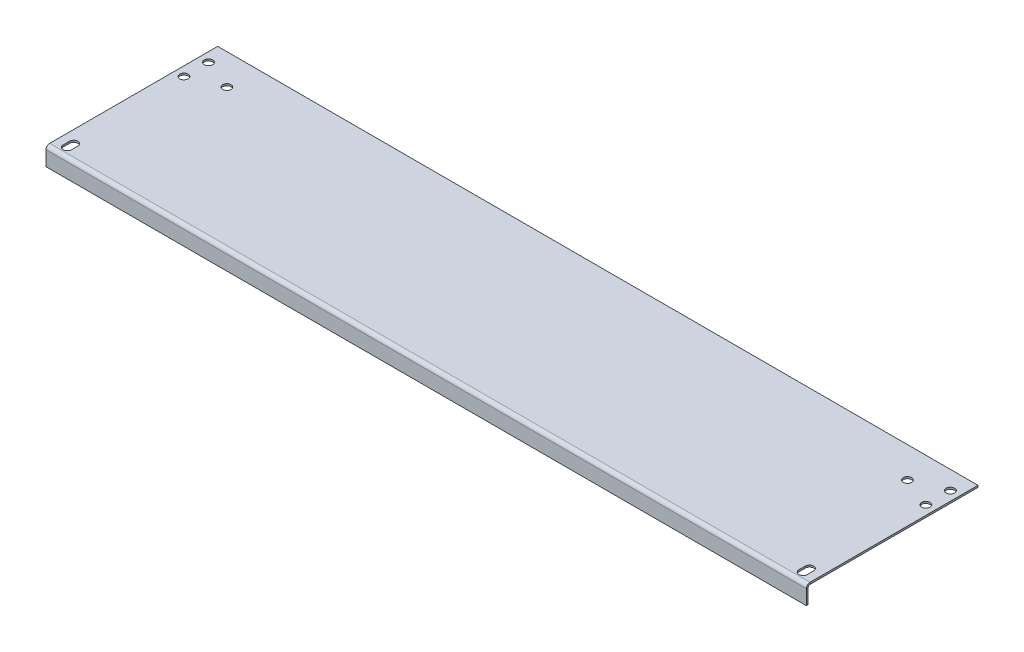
ISO-10303-21;
HEADER;
FILE_DESCRIPTION(('STEP AP214'),'2;1');
FILE_NAME('part.step','',(''),(''),'','','');
FILE_SCHEMA(('AUTOMOTIVE_DESIGN { 1 0 10303 214 1 1 1 1 }'));
ENDSEC;
DATA;
#1=APPLICATION_CONTEXT('core data for automotive mechanical design processes');
#2=APPLICATION_PROTOCOL_DEFINITION('international standard','automotive_design',2000,#1);
#3=PRODUCT_CONTEXT('',#1,'mechanical');
#4=PRODUCT('Part','Part','',(#3));
#5=PRODUCT_RELATED_PRODUCT_CATEGORY('part','',(#4));
#6=PRODUCT_DEFINITION_FORMATION('','',#4);
#7=PRODUCT_DEFINITION_CONTEXT('part definition',#1,'design');
#8=PRODUCT_DEFINITION('design','',#6,#7);
#9=PRODUCT_DEFINITION_SHAPE('','',#8);
#10=(LENGTH_UNIT() NAMED_UNIT(*) SI_UNIT(.MILLI.,.METRE.));
#11=(NAMED_UNIT(*) PLANE_ANGLE_UNIT() SI_UNIT($,.RADIAN.));
#12=(NAMED_UNIT(*) SI_UNIT($,.STERADIAN.) SOLID_ANGLE_UNIT());
#13=UNCERTAINTY_MEASURE_WITH_UNIT(LENGTH_MEASURE(1.E-05),#10,'distance_accuracy_value','');
#14=(GEOMETRIC_REPRESENTATION_CONTEXT(3) GLOBAL_UNCERTAINTY_ASSIGNED_CONTEXT((#13)) GLOBAL_UNIT_ASSIGNED_CONTEXT((#10,
#11,#12)) REPRESENTATION_CONTEXT('',''));
#15=CARTESIAN_POINT('',(0.,0.,0.));
#16=DIRECTION('',(0.,0.,1.));
#17=DIRECTION('',(1.,0.,0.));
#18=AXIS2_PLACEMENT_3D('',#15,#16,#17);
#19=CARTESIAN_POINT('',(310.,-1.5,0.));
#20=DIRECTION('',(0.,1.,0.));
#21=DIRECTION('',(0.,0.,1.));
#22=AXIS2_PLACEMENT_3D('',#19,#20,#21);
#23=PLANE('',#22);
#24=CARTESIAN_POINT('',(-302.5,-1.5,-125.));
#25=DIRECTION('',(0.,1.,0.));
#26=DIRECTION('',(0.,0.,1.));
#27=AXIS2_PLACEMENT_3D('',#24,#25,#26);
#28=CIRCLE('',#27,3.39999999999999);
#29=CARTESIAN_POINT('',(-302.5,-1.5,-121.6));
#30=VERTEX_POINT('',#29);
#31=EDGE_CURVE('E498',#30,#30,#28,.T.);
#32=ORIENTED_EDGE('',*,*,#31,.T.);
#33=EDGE_LOOP('',(#32));
#34=FACE_BOUND('',#33,.T.);
#35=CARTESIAN_POINT('',(-302.5,-1.5,-105.));
#36=DIRECTION('',(0.,1.,0.));
#37=DIRECTION('',(0.,0.,1.));
#38=AXIS2_PLACEMENT_3D('',#35,#36,#37);
#39=CIRCLE('',#38,3.39999999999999);
#40=CARTESIAN_POINT('',(-302.5,-1.5,-101.6));
#41=VERTEX_POINT('',#40);
#42=EDGE_CURVE('E504',#41,#41,#39,.T.);
#43=ORIENTED_EDGE('',*,*,#42,.T.);
#44=EDGE_LOOP('',(#43));
#45=FACE_BOUND('',#44,.T.);
#46=CARTESIAN_POINT('',(-277.5,-1.5,-115.));
#47=DIRECTION('',(0.,1.,0.));
#48=DIRECTION('',(0.,0.,1.));
#49=AXIS2_PLACEMENT_3D('',#46,#47,#48);
#50=CIRCLE('',#49,3.39999999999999);
#51=CARTESIAN_POINT('',(-277.5,-1.5,-111.6));
#52=VERTEX_POINT('',#51);
#53=EDGE_CURVE('E516',#52,#52,#50,.T.);
#54=ORIENTED_EDGE('',*,*,#53,.T.);
#55=EDGE_LOOP('',(#54));
#56=FACE_BOUND('',#55,.T.);
#57=DIRECTION('',(0.,0.,-1.));
#58=VECTOR('',#57,1.);
#59=CARTESIAN_POINT('',(-310.,-1.5,0.));
#60=LINE('',#59,#58);
#61=CARTESIAN_POINT('',(-310.,-1.5,-3.));
#62=VERTEX_POINT('',#61);
#63=CARTESIAN_POINT('',(-310.,-1.5,-140.));
#64=VERTEX_POINT('',#63);
#65=EDGE_CURVE('E262',#62,#64,#60,.T.);
#66=ORIENTED_EDGE('',*,*,#65,.T.);
#67=DIRECTION('',(-1.,0.,0.));
#68=VECTOR('',#67,1.);
#69=CARTESIAN_POINT('',(310.,-1.5,-140.));
#70=LINE('',#69,#68);
#71=CARTESIAN_POINT('',(310.,-1.5,-140.));
#72=VERTEX_POINT('',#71);
#73=EDGE_CURVE('E349',#72,#64,#70,.T.);
#74=ORIENTED_EDGE('',*,*,#73,.F.);
#75=DIRECTION('',(0.,0.,-1.));
#76=VECTOR('',#75,1.);
#77=CARTESIAN_POINT('',(310.,-1.5,0.));
#78=LINE('',#77,#76);
#79=CARTESIAN_POINT('',(310.,-1.5,-3.));
#80=VERTEX_POINT('',#79);
#81=EDGE_CURVE('E293',#80,#72,#78,.T.);
#82=ORIENTED_EDGE('',*,*,#81,.F.);
#83=DIRECTION('',(-1.,0.,0.));
#84=VECTOR('',#83,1.);
#85=CARTESIAN_POINT('',(310.,-1.5,-3.));
#86=LINE('',#85,#84);
#87=EDGE_CURVE('E324',#80,#62,#86,.T.);
#88=ORIENTED_EDGE('',*,*,#87,.T.);
#89=EDGE_LOOP('',(#66,#74,#82,#88));
#90=FACE_BOUND('',#89,.T.);
#91=DIRECTION('',(0.,0.,1.));
#92=VECTOR('',#91,1.);
#93=CARTESIAN_POINT('',(303.4,-1.5,-12.6));
#94=LINE('',#93,#92);
#95=CARTESIAN_POINT('',(303.4,-1.5,-12.6));
#96=VERTEX_POINT('',#95);
#97=CARTESIAN_POINT('',(303.4,-1.5,-7.39999999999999));
#98=VERTEX_POINT('',#97);
#99=EDGE_CURVE('E222',#96,#98,#94,.T.);
#100=ORIENTED_EDGE('',*,*,#99,.F.);
#101=CARTESIAN_POINT('',(300.,-1.5,-12.6));
#102=DIRECTION('',(0.,1.,0.));
#103=DIRECTION('',(0.,0.,1.));
#104=AXIS2_PLACEMENT_3D('',#101,#102,#103);
#105=CIRCLE('',#104,3.40000000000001);
#106=CARTESIAN_POINT('',(296.6,-1.5,-12.6));
#107=VERTEX_POINT('',#106);
#108=EDGE_CURVE('E226',#107,#96,#105,.F.);
#109=ORIENTED_EDGE('',*,*,#108,.F.);
#110=DIRECTION('',(0.,0.,-1.));
#111=VECTOR('',#110,1.);
#112=CARTESIAN_POINT('',(296.6,-1.5,-12.6));
#113=LINE('',#112,#111);
#114=CARTESIAN_POINT('',(296.6,-1.5,-7.39999999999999));
#115=VERTEX_POINT('',#114);
#116=EDGE_CURVE('E249',#115,#107,#113,.T.);
#117=ORIENTED_EDGE('',*,*,#116,.F.);
#118=CARTESIAN_POINT('',(300.,-1.5,-7.39999999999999));
#119=DIRECTION('',(0.,1.,0.));
#120=DIRECTION('',(0.,0.,1.));
#121=AXIS2_PLACEMENT_3D('',#118,#119,#120);
#122=CIRCLE('',#121,3.40000000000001);
#123=EDGE_CURVE('E219',#98,#115,#122,.F.);
#124=ORIENTED_EDGE('',*,*,#123,.F.);
#125=EDGE_LOOP('',(#100,#109,#117,#124));
#126=FACE_BOUND('',#125,.T.);
#127=CARTESIAN_POINT('',(277.5,-1.5,-115.));
#128=DIRECTION('',(0.,1.,0.));
#129=DIRECTION('',(0.,0.,1.));
#130=AXIS2_PLACEMENT_3D('',#127,#128,#129);
#131=CIRCLE('',#130,3.39999999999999);
#132=CARTESIAN_POINT('',(277.5,-1.5,-111.6));
#133=VERTEX_POINT('',#132);
#134=EDGE_CURVE('E215',#133,#133,#131,.T.);
#135=ORIENTED_EDGE('',*,*,#134,.T.);
#136=EDGE_LOOP('',(#135));
#137=FACE_BOUND('',#136,.T.);
#138=CARTESIAN_POINT('',(302.5,-1.5,-105.));
#139=DIRECTION('',(0.,1.,0.));
#140=DIRECTION('',(0.,0.,1.));
#141=AXIS2_PLACEMENT_3D('',#138,#139,#140);
#142=CIRCLE('',#141,3.39999999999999);
#143=CARTESIAN_POINT('',(302.5,-1.5,-101.6));
#144=VERTEX_POINT('',#143);
#145=EDGE_CURVE('E207',#144,#144,#142,.T.);
#146=ORIENTED_EDGE('',*,*,#145,.T.);
#147=EDGE_LOOP('',(#146));
#148=FACE_BOUND('',#147,.T.);
#149=CARTESIAN_POINT('',(302.5,-1.5,-125.));
#150=DIRECTION('',(0.,1.,0.));
#151=DIRECTION('',(0.,0.,1.));
#152=AXIS2_PLACEMENT_3D('',#149,#150,#151);
#153=CIRCLE('',#152,3.39999999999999);
#154=CARTESIAN_POINT('',(302.5,-1.5,-121.6));
#155=VERTEX_POINT('',#154);
#156=EDGE_CURVE('E199',#155,#155,#153,.T.);
#157=ORIENTED_EDGE('',*,*,#156,.T.);
#158=EDGE_LOOP('',(#157));
#159=FACE_BOUND('',#158,.T.);
#160=CARTESIAN_POINT('',(-300.,-1.5,-12.6));
#161=DIRECTION('',(0.,1.,0.));
#162=DIRECTION('',(0.,0.,1.));
#163=AXIS2_PLACEMENT_3D('',#160,#161,#162);
#164=CIRCLE('',#163,3.40000000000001);
#165=CARTESIAN_POINT('',(-296.6,-1.5,-12.6));
#166=VERTEX_POINT('',#165);
#167=CARTESIAN_POINT('',(-303.4,-1.5,-12.6));
#168=VERTEX_POINT('',#167);
#169=EDGE_CURVE('E162',#166,#168,#164,.T.);
#170=ORIENTED_EDGE('',*,*,#169,.T.);
#171=DIRECTION('',(0.,0.,1.));
#172=VECTOR('',#171,1.);
#173=CARTESIAN_POINT('',(-303.4,-1.5,-12.6));
#174=LINE('',#173,#172);
#175=CARTESIAN_POINT('',(-303.4,-1.5,-7.39999999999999));
#176=VERTEX_POINT('',#175);
#177=EDGE_CURVE('E150',#168,#176,#174,.T.);
#178=ORIENTED_EDGE('',*,*,#177,.T.);
#179=CARTESIAN_POINT('',(-300.,-1.5,-7.39999999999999));
#180=DIRECTION('',(0.,1.,0.));
#181=DIRECTION('',(0.,0.,1.));
#182=AXIS2_PLACEMENT_3D('',#179,#180,#181);
#183=CIRCLE('',#182,3.40000000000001);
#184=CARTESIAN_POINT('',(-296.6,-1.5,-7.39999999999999));
#185=VERTEX_POINT('',#184);
#186=EDGE_CURVE('E176',#176,#185,#183,.T.);
#187=ORIENTED_EDGE('',*,*,#186,.T.);
#188=DIRECTION('',(0.,0.,-1.));
#189=VECTOR('',#188,1.);
#190=CARTESIAN_POINT('',(-296.6,-1.5,-12.6));
#191=LINE('',#190,#189);
#192=EDGE_CURVE('E168',#185,#166,#191,.T.);
#193=ORIENTED_EDGE('',*,*,#192,.T.);
#194=EDGE_LOOP('',(#170,#178,#187,#193));
#195=FACE_BOUND('',#194,.T.);
#196=ADVANCED_FACE('F38',(#34,#45,#56,#90,#126,#137,#148,#159,#195),#23,.F.);
#197=CARTESIAN_POINT('',(310.,0.,0.));
#198=DIRECTION('',(0.,1.,0.));
#199=DIRECTION('',(0.,0.,1.));
#200=AXIS2_PLACEMENT_3D('',#197,#198,#199);
#201=PLANE('',#200);
#202=CARTESIAN_POINT('',(-302.5,0.,-125.));
#203=DIRECTION('',(0.,1.,0.));
#204=DIRECTION('',(0.,0.,1.));
#205=AXIS2_PLACEMENT_3D('',#202,#203,#204);
#206=CIRCLE('',#205,3.40000000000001);
#207=CARTESIAN_POINT('',(-302.5,0.,-121.6));
#208=VERTEX_POINT('',#207);
#209=EDGE_CURVE('E496',#208,#208,#206,.T.);
#210=ORIENTED_EDGE('',*,*,#209,.F.);
#211=EDGE_LOOP('',(#210));
#212=FACE_BOUND('',#211,.T.);
#213=CARTESIAN_POINT('',(-302.5,0.,-105.));
#214=DIRECTION('',(0.,1.,0.));
#215=DIRECTION('',(0.,0.,1.));
#216=AXIS2_PLACEMENT_3D('',#213,#214,#215);
#217=CIRCLE('',#216,3.40000000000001);
#218=CARTESIAN_POINT('',(-302.5,0.,-101.6));
#219=VERTEX_POINT('',#218);
#220=EDGE_CURVE('E500',#219,#219,#217,.T.);
#221=ORIENTED_EDGE('',*,*,#220,.F.);
#222=EDGE_LOOP('',(#221));
#223=FACE_BOUND('',#222,.T.);
#224=CARTESIAN_POINT('',(-277.5,0.,-115.));
#225=DIRECTION('',(0.,1.,0.));
#226=DIRECTION('',(0.,0.,1.));
#227=AXIS2_PLACEMENT_3D('',#224,#225,#226);
#228=CIRCLE('',#227,3.40000000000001);
#229=CARTESIAN_POINT('',(-277.5,0.,-111.6));
#230=VERTEX_POINT('',#229);
#231=EDGE_CURVE('E512',#230,#230,#228,.T.);
#232=ORIENTED_EDGE('',*,*,#231,.F.);
#233=EDGE_LOOP('',(#232));
#234=FACE_BOUND('',#233,.T.);
#235=DIRECTION('',(0.,0.,-1.));
#236=VECTOR('',#235,1.);
#237=CARTESIAN_POINT('',(-310.,0.,0.));
#238=LINE('',#237,#236);
#239=CARTESIAN_POINT('',(-310.,0.,-3.));
#240=VERTEX_POINT('',#239);
#241=CARTESIAN_POINT('',(-310.,0.,-140.));
#242=VERTEX_POINT('',#241);
#243=EDGE_CURVE('E269',#240,#242,#238,.T.);
#244=ORIENTED_EDGE('',*,*,#243,.F.);
#245=DIRECTION('',(-1.,0.,0.));
#246=VECTOR('',#245,1.);
#247=CARTESIAN_POINT('',(310.,0.,-3.));
#248=LINE('',#247,#246);
#249=CARTESIAN_POINT('',(310.,0.,-3.));
#250=VERTEX_POINT('',#249);
#251=EDGE_CURVE('E342',#250,#240,#248,.T.);
#252=ORIENTED_EDGE('',*,*,#251,.F.);
#253=DIRECTION('',(0.,0.,-1.));
#254=VECTOR('',#253,1.);
#255=CARTESIAN_POINT('',(310.,0.,0.));
#256=LINE('',#255,#254);
#257=CARTESIAN_POINT('',(310.,0.,-140.));
#258=VERTEX_POINT('',#257);
#259=EDGE_CURVE('E300',#250,#258,#256,.T.);
#260=ORIENTED_EDGE('',*,*,#259,.T.);
#261=DIRECTION('',(-1.,0.,0.));
#262=VECTOR('',#261,1.);
#263=CARTESIAN_POINT('',(310.,0.,-140.));
#264=LINE('',#263,#262);
#265=EDGE_CURVE('E346',#258,#242,#264,.T.);
#266=ORIENTED_EDGE('',*,*,#265,.T.);
#267=EDGE_LOOP('',(#244,#252,#260,#266));
#268=FACE_BOUND('',#267,.T.);
#269=CARTESIAN_POINT('',(300.,0.,-12.6));
#270=DIRECTION('',(0.,1.,0.));
#271=DIRECTION('',(0.,0.,-1.));
#272=AXIS2_PLACEMENT_3D('',#269,#270,#271);
#273=CIRCLE('',#272,3.40000000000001);
#274=CARTESIAN_POINT('',(303.4,0.,-12.6));
#275=VERTEX_POINT('',#274);
#276=CARTESIAN_POINT('',(296.6,0.,-12.6));
#277=VERTEX_POINT('',#276);
#278=EDGE_CURVE('E230',#275,#277,#273,.T.);
#279=ORIENTED_EDGE('',*,*,#278,.F.);
#280=DIRECTION('',(0.,0.,-1.));
#281=VECTOR('',#280,1.);
#282=CARTESIAN_POINT('',(303.4,0.,-12.6));
#283=LINE('',#282,#281);
#284=CARTESIAN_POINT('',(303.4,0.,-7.39999999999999));
#285=VERTEX_POINT('',#284);
#286=EDGE_CURVE('E241',#285,#275,#283,.T.);
#287=ORIENTED_EDGE('',*,*,#286,.F.);
#288=CARTESIAN_POINT('',(300.,0.,-7.39999999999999));
#289=DIRECTION('',(0.,1.,0.));
#290=DIRECTION('',(0.,0.,1.));
#291=AXIS2_PLACEMENT_3D('',#288,#289,#290);
#292=CIRCLE('',#291,3.40000000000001);
#293=CARTESIAN_POINT('',(296.6,0.,-7.39999999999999));
#294=VERTEX_POINT('',#293);
#295=EDGE_CURVE('E237',#294,#285,#292,.T.);
#296=ORIENTED_EDGE('',*,*,#295,.F.);
#297=DIRECTION('',(0.,0.,1.));
#298=VECTOR('',#297,1.);
#299=CARTESIAN_POINT('',(296.6,0.,-12.6));
#300=LINE('',#299,#298);
#301=EDGE_CURVE('E233',#277,#294,#300,.T.);
#302=ORIENTED_EDGE('',*,*,#301,.F.);
#303=EDGE_LOOP('',(#279,#287,#296,#302));
#304=FACE_BOUND('',#303,.T.);
#305=CARTESIAN_POINT('',(277.5,0.,-115.));
#306=DIRECTION('',(0.,1.,0.));
#307=DIRECTION('',(0.,0.,1.));
#308=AXIS2_PLACEMENT_3D('',#305,#306,#307);
#309=CIRCLE('',#308,3.40000000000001);
#310=CARTESIAN_POINT('',(277.5,0.,-111.6));
#311=VERTEX_POINT('',#310);
#312=EDGE_CURVE('E211',#311,#311,#309,.T.);
#313=ORIENTED_EDGE('',*,*,#312,.F.);
#314=EDGE_LOOP('',(#313));
#315=FACE_BOUND('',#314,.T.);
#316=CARTESIAN_POINT('',(302.5,0.,-105.));
#317=DIRECTION('',(0.,1.,0.));
#318=DIRECTION('',(0.,0.,1.));
#319=AXIS2_PLACEMENT_3D('',#316,#317,#318);
#320=CIRCLE('',#319,3.40000000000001);
#321=CARTESIAN_POINT('',(302.5,0.,-101.6));
#322=VERTEX_POINT('',#321);
#323=EDGE_CURVE('E203',#322,#322,#320,.T.);
#324=ORIENTED_EDGE('',*,*,#323,.F.);
#325=EDGE_LOOP('',(#324));
#326=FACE_BOUND('',#325,.T.);
#327=CARTESIAN_POINT('',(302.5,0.,-125.));
#328=DIRECTION('',(0.,1.,0.));
#329=DIRECTION('',(0.,0.,1.));
#330=AXIS2_PLACEMENT_3D('',#327,#328,#329);
#331=CIRCLE('',#330,3.40000000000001);
#332=CARTESIAN_POINT('',(302.5,0.,-121.6));
#333=VERTEX_POINT('',#332);
#334=EDGE_CURVE('E158',#333,#333,#331,.T.);
#335=ORIENTED_EDGE('',*,*,#334,.F.);
#336=EDGE_LOOP('',(#335));
#337=FACE_BOUND('',#336,.T.);
#338=DIRECTION('',(0.,0.,-1.));
#339=VECTOR('',#338,1.);
#340=CARTESIAN_POINT('',(-303.4,0.,-12.6));
#341=LINE('',#340,#339);
#342=CARTESIAN_POINT('',(-303.4,0.,-7.39999999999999));
#343=VERTEX_POINT('',#342);
#344=CARTESIAN_POINT('',(-303.4,0.,-12.6));
#345=VERTEX_POINT('',#344);
#346=EDGE_CURVE('E173',#343,#345,#341,.T.);
#347=ORIENTED_EDGE('',*,*,#346,.T.);
#348=CARTESIAN_POINT('',(-300.,0.,-12.6));
#349=DIRECTION('',(0.,-1.,0.));
#350=DIRECTION('',(0.,0.,-1.));
#351=AXIS2_PLACEMENT_3D('',#348,#349,#350);
#352=CIRCLE('',#351,3.40000000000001);
#353=CARTESIAN_POINT('',(-296.6,0.,-12.6));
#354=VERTEX_POINT('',#353);
#355=EDGE_CURVE('E62',#345,#354,#352,.T.);
#356=ORIENTED_EDGE('',*,*,#355,.T.);
#357=DIRECTION('',(0.,0.,1.));
#358=VECTOR('',#357,1.);
#359=CARTESIAN_POINT('',(-296.6,0.,-12.6));
#360=LINE('',#359,#358);
#361=CARTESIAN_POINT('',(-296.6,0.,-7.39999999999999));
#362=VERTEX_POINT('',#361);
#363=EDGE_CURVE('E165',#354,#362,#360,.T.);
#364=ORIENTED_EDGE('',*,*,#363,.T.);
#365=CARTESIAN_POINT('',(-300.,0.,-7.39999999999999));
#366=DIRECTION('',(0.,-1.,0.));
#367=DIRECTION('',(0.,0.,1.));
#368=AXIS2_PLACEMENT_3D('',#365,#366,#367);
#369=CIRCLE('',#368,3.40000000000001);
#370=EDGE_CURVE('E182',#362,#343,#369,.T.);
#371=ORIENTED_EDGE('',*,*,#370,.T.);
#372=EDGE_LOOP('',(#347,#356,#364,#371));
#373=FACE_BOUND('',#372,.T.);
#374=ADVANCED_FACE('F396',(#212,#223,#234,#268,#304,#315,#326,#337,#373),#201,.T.);
#375=CARTESIAN_POINT('',(310.,0.,-3.));
#376=DIRECTION('',(1.,0.,0.));
#377=DIRECTION('',(0.,0.,-1.));
#378=AXIS2_PLACEMENT_3D('',#375,#376,#377);
#379=PLANE('',#378);
#380=DIRECTION('',(0.,-1.,0.));
#381=VECTOR('',#380,1.);
#382=CARTESIAN_POINT('',(310.,0.,-3.));
#383=LINE('',#382,#381);
#384=EDGE_CURVE('E11',#250,#80,#383,.T.);
#385=ORIENTED_EDGE('',*,*,#384,.F.);
#386=CARTESIAN_POINT('',(310.,-3.,-3.));
#387=DIRECTION('',(1.,0.,0.));
#388=DIRECTION('',(0.,0.,-1.));
#389=AXIS2_PLACEMENT_3D('',#386,#387,#388);
#390=CIRCLE('',#389,3.);
#391=CARTESIAN_POINT('',(310.,-3.,0.));
#392=VERTEX_POINT('',#391);
#393=EDGE_CURVE('E304',#392,#250,#390,.F.);
#394=ORIENTED_EDGE('',*,*,#393,.F.);
#395=DIRECTION('',(0.,0.,1.));
#396=VECTOR('',#395,1.);
#397=CARTESIAN_POINT('',(310.,-3.,-1.5));
#398=LINE('',#397,#396);
#399=CARTESIAN_POINT('',(310.,-3.,-1.5));
#400=VERTEX_POINT('',#399);
#401=EDGE_CURVE('E47',#400,#392,#398,.T.);
#402=ORIENTED_EDGE('',*,*,#401,.F.);
#403=CARTESIAN_POINT('',(310.,-3.,-3.));
#404=DIRECTION('',(1.,0.,0.));
#405=DIRECTION('',(0.,0.,-1.));
#406=AXIS2_PLACEMENT_3D('',#403,#404,#405);
#407=CIRCLE('',#406,1.5);
#408=EDGE_CURVE('E320',#400,#80,#407,.F.);
#409=ORIENTED_EDGE('',*,*,#408,.T.);
#410=EDGE_LOOP('',(#385,#394,#402,#409));
#411=FACE_BOUND('',#410,.T.);
#412=ADVANCED_FACE('F40',(#411),#379,.T.);
#413=CARTESIAN_POINT('',(310.,-3.,-1.5));
#414=DIRECTION('',(1.,0.,0.));
#415=DIRECTION('',(0.,0.,-1.));
#416=AXIS2_PLACEMENT_3D('',#413,#414,#415);
#417=PLANE('',#416);
#418=ORIENTED_EDGE('',*,*,#259,.F.);
#419=ORIENTED_EDGE('',*,*,#384,.T.);
#420=ORIENTED_EDGE('',*,*,#81,.T.);
#421=DIRECTION('',(0.,-1.,0.));
#422=VECTOR('',#421,1.);
#423=CARTESIAN_POINT('',(310.,0.,-140.));
#424=LINE('',#423,#422);
#425=EDGE_CURVE('E296',#258,#72,#424,.T.);
#426=ORIENTED_EDGE('',*,*,#425,.F.);
#427=EDGE_LOOP('',(#418,#419,#420,#426));
#428=FACE_BOUND('',#427,.T.);
#429=ADVANCED_FACE('F393',(#428),#417,.T.);
#430=CARTESIAN_POINT('',(-310.,-3.,0.));
#431=DIRECTION('',(-1.,0.,0.));
#432=DIRECTION('',(0.,0.,1.));
#433=AXIS2_PLACEMENT_3D('',#430,#431,#432);
#434=PLANE('',#433);
#435=DIRECTION('',(0.,0.,-1.));
#436=VECTOR('',#435,1.);
#437=CARTESIAN_POINT('',(-310.,-3.,0.));
#438=LINE('',#437,#436);
#439=CARTESIAN_POINT('',(-310.,-3.,0.));
#440=VERTEX_POINT('',#439);
#441=CARTESIAN_POINT('',(-310.,-3.,-1.5));
#442=VERTEX_POINT('',#441);
#443=EDGE_CURVE('E355',#440,#442,#438,.T.);
#444=ORIENTED_EDGE('',*,*,#443,.F.);
#445=CARTESIAN_POINT('',(-310.,-3.,-3.));
#446=DIRECTION('',(1.,0.,0.));
#447=DIRECTION('',(0.,0.,-1.));
#448=AXIS2_PLACEMENT_3D('',#445,#446,#447);
#449=CIRCLE('',#448,3.);
#450=EDGE_CURVE('E273',#440,#240,#449,.F.);
#451=ORIENTED_EDGE('',*,*,#450,.T.);
#452=DIRECTION('',(0.,1.,0.));
#453=VECTOR('',#452,1.);
#454=CARTESIAN_POINT('',(-310.,-1.5,-3.));
#455=LINE('',#454,#453);
#456=EDGE_CURVE('E352',#62,#240,#455,.T.);
#457=ORIENTED_EDGE('',*,*,#456,.F.);
#458=CARTESIAN_POINT('',(-310.,-3.,-3.));
#459=DIRECTION('',(1.,0.,0.));
#460=DIRECTION('',(0.,0.,-1.));
#461=AXIS2_PLACEMENT_3D('',#458,#459,#460);
#462=CIRCLE('',#461,1.5);
#463=EDGE_CURVE('E289',#442,#62,#462,.F.);
#464=ORIENTED_EDGE('',*,*,#463,.F.);
#465=EDGE_LOOP('',(#444,#451,#457,#464));
#466=FACE_BOUND('',#465,.T.);
#467=ADVANCED_FACE('F401',(#466),#434,.T.);
#468=CARTESIAN_POINT('',(-310.,-1.5,-3.));
#469=DIRECTION('',(-1.,0.,0.));
#470=DIRECTION('',(0.,0.,1.));
#471=AXIS2_PLACEMENT_3D('',#468,#469,#470);
#472=PLANE('',#471);
#473=DIRECTION('',(0.,1.,0.));
#474=VECTOR('',#473,1.);
#475=CARTESIAN_POINT('',(-310.,-15.,0.));
#476=LINE('',#475,#474);
#477=CARTESIAN_POINT('',(-310.,-15.,0.));
#478=VERTEX_POINT('',#477);
#479=EDGE_CURVE('E277',#478,#440,#476,.T.);
#480=ORIENTED_EDGE('',*,*,#479,.T.);
#481=ORIENTED_EDGE('',*,*,#443,.T.);
#482=DIRECTION('',(0.,1.,0.));
#483=VECTOR('',#482,1.);
#484=CARTESIAN_POINT('',(-310.,-15.,-1.5));
#485=LINE('',#484,#483);
#486=CARTESIAN_POINT('',(-310.,-15.,-1.5));
#487=VERTEX_POINT('',#486);
#488=EDGE_CURVE('E285',#487,#442,#485,.T.);
#489=ORIENTED_EDGE('',*,*,#488,.F.);
#490=DIRECTION('',(0.,0.,1.));
#491=VECTOR('',#490,1.);
#492=CARTESIAN_POINT('',(-310.,-15.,-1.5));
#493=LINE('',#492,#491);
#494=EDGE_CURVE('E281',#487,#478,#493,.T.);
#495=ORIENTED_EDGE('',*,*,#494,.T.);
#496=EDGE_LOOP('',(#480,#481,#489,#495));
#497=FACE_BOUND('',#496,.T.);
#498=ADVANCED_FACE('F403',(#497),#472,.T.);
#499=CARTESIAN_POINT('',(310.,0.,-140.));
#500=DIRECTION('',(0.,0.,-1.));
#501=DIRECTION('',(-1.,0.,0.));
#502=AXIS2_PLACEMENT_3D('',#499,#500,#501);
#503=PLANE('',#502);
#504=DIRECTION('',(0.,-1.,0.));
#505=VECTOR('',#504,1.);
#506=CARTESIAN_POINT('',(-310.,0.,-140.));
#507=LINE('',#506,#505);
#508=EDGE_CURVE('E265',#242,#64,#507,.T.);
#509=ORIENTED_EDGE('',*,*,#508,.F.);
#510=ORIENTED_EDGE('',*,*,#265,.F.);
#511=ORIENTED_EDGE('',*,*,#425,.T.);
#512=ORIENTED_EDGE('',*,*,#73,.T.);
#513=EDGE_LOOP('',(#509,#510,#511,#512));
#514=FACE_BOUND('',#513,.T.);
#515=ADVANCED_FACE('F405',(#514),#503,.T.);
#516=CARTESIAN_POINT('',(310.,-3.,-3.));
#517=DIRECTION('',(-1.,0.,0.));
#518=DIRECTION('',(0.,0.,1.));
#519=AXIS2_PLACEMENT_3D('',#516,#517,#518);
#520=CYLINDRICAL_SURFACE('',#519,3.);
#521=ORIENTED_EDGE('',*,*,#450,.F.);
#522=DIRECTION('',(-1.,0.,0.));
#523=VECTOR('',#522,1.);
#524=CARTESIAN_POINT('',(310.,-3.,0.));
#525=LINE('',#524,#523);
#526=EDGE_CURVE('E338',#392,#440,#525,.T.);
#527=ORIENTED_EDGE('',*,*,#526,.F.);
#528=ORIENTED_EDGE('',*,*,#393,.T.);
#529=ORIENTED_EDGE('',*,*,#251,.T.);
#530=EDGE_LOOP('',(#521,#527,#528,#529));
#531=FACE_BOUND('',#530,.T.);
#532=ADVANCED_FACE('F369',(#531),#520,.T.);
#533=CARTESIAN_POINT('',(310.,-15.,0.));
#534=DIRECTION('',(0.,0.,1.));
#535=DIRECTION('',(1.,0.,0.));
#536=AXIS2_PLACEMENT_3D('',#533,#534,#535);
#537=PLANE('',#536);
#538=ORIENTED_EDGE('',*,*,#479,.F.);
#539=DIRECTION('',(-1.,0.,0.));
#540=VECTOR('',#539,1.);
#541=CARTESIAN_POINT('',(310.,-15.,0.));
#542=LINE('',#541,#540);
#543=CARTESIAN_POINT('',(310.,-15.,0.));
#544=VERTEX_POINT('',#543);
#545=EDGE_CURVE('E335',#544,#478,#542,.T.);
#546=ORIENTED_EDGE('',*,*,#545,.F.);
#547=DIRECTION('',(0.,1.,0.));
#548=VECTOR('',#547,1.);
#549=CARTESIAN_POINT('',(310.,-15.,0.));
#550=LINE('',#549,#548);
#551=EDGE_CURVE('E308',#544,#392,#550,.T.);
#552=ORIENTED_EDGE('',*,*,#551,.T.);
#553=ORIENTED_EDGE('',*,*,#526,.T.);
#554=EDGE_LOOP('',(#538,#546,#552,#553));
#555=FACE_BOUND('',#554,.T.);
#556=ADVANCED_FACE('F373',(#555),#537,.T.);
#557=CARTESIAN_POINT('',(310.,-15.,-1.5));
#558=DIRECTION('',(0.,-1.,0.));
#559=DIRECTION('',(0.,0.,-1.));
#560=AXIS2_PLACEMENT_3D('',#557,#558,#559);
#561=PLANE('',#560);
#562=ORIENTED_EDGE('',*,*,#494,.F.);
#563=DIRECTION('',(-1.,0.,0.));
#564=VECTOR('',#563,1.);
#565=CARTESIAN_POINT('',(310.,-15.,-1.5));
#566=LINE('',#565,#564);
#567=CARTESIAN_POINT('',(310.,-15.,-1.5));
#568=VERTEX_POINT('',#567);
#569=EDGE_CURVE('E332',#568,#487,#566,.T.);
#570=ORIENTED_EDGE('',*,*,#569,.F.);
#571=DIRECTION('',(0.,0.,1.));
#572=VECTOR('',#571,1.);
#573=CARTESIAN_POINT('',(310.,-15.,-1.5));
#574=LINE('',#573,#572);
#575=EDGE_CURVE('E312',#568,#544,#574,.T.);
#576=ORIENTED_EDGE('',*,*,#575,.T.);
#577=ORIENTED_EDGE('',*,*,#545,.T.);
#578=EDGE_LOOP('',(#562,#570,#576,#577));
#579=FACE_BOUND('',#578,.T.);
#580=ADVANCED_FACE('F376',(#579),#561,.T.);
#581=CARTESIAN_POINT('',(310.,-15.,-1.5));
#582=DIRECTION('',(0.,0.,1.));
#583=DIRECTION('',(1.,0.,0.));
#584=AXIS2_PLACEMENT_3D('',#581,#582,#583);
#585=PLANE('',#584);
#586=ORIENTED_EDGE('',*,*,#488,.T.);
#587=DIRECTION('',(-1.,0.,0.));
#588=VECTOR('',#587,1.);
#589=CARTESIAN_POINT('',(310.,-3.,-1.5));
#590=LINE('',#589,#588);
#591=EDGE_CURVE('E328',#400,#442,#590,.T.);
#592=ORIENTED_EDGE('',*,*,#591,.F.);
#593=DIRECTION('',(0.,1.,0.));
#594=VECTOR('',#593,1.);
#595=CARTESIAN_POINT('',(310.,-15.,-1.5));
#596=LINE('',#595,#594);
#597=EDGE_CURVE('E316',#568,#400,#596,.T.);
#598=ORIENTED_EDGE('',*,*,#597,.F.);
#599=ORIENTED_EDGE('',*,*,#569,.T.);
#600=EDGE_LOOP('',(#586,#592,#598,#599));
#601=FACE_BOUND('',#600,.T.);
#602=ADVANCED_FACE('F379',(#601),#585,.F.);
#603=CARTESIAN_POINT('',(310.,-3.,-3.));
#604=DIRECTION('',(-1.,0.,0.));
#605=DIRECTION('',(0.,0.,1.));
#606=AXIS2_PLACEMENT_3D('',#603,#604,#605);
#607=CYLINDRICAL_SURFACE('',#606,1.5);
#608=ORIENTED_EDGE('',*,*,#463,.T.);
#609=ORIENTED_EDGE('',*,*,#87,.F.);
#610=ORIENTED_EDGE('',*,*,#408,.F.);
#611=ORIENTED_EDGE('',*,*,#591,.T.);
#612=EDGE_LOOP('',(#608,#609,#610,#611));
#613=FACE_BOUND('',#612,.T.);
#614=ADVANCED_FACE('F384',(#613),#607,.F.);
#615=CARTESIAN_POINT('',(310.,-3.,-3.));
#616=DIRECTION('',(1.,0.,0.));
#617=DIRECTION('',(0.,0.,-1.));
#618=AXIS2_PLACEMENT_3D('',#615,#616,#617);
#619=PLANE('',#618);
#620=ORIENTED_EDGE('',*,*,#597,.T.);
#621=ORIENTED_EDGE('',*,*,#401,.T.);
#622=ORIENTED_EDGE('',*,*,#551,.F.);
#623=ORIENTED_EDGE('',*,*,#575,.F.);
#624=EDGE_LOOP('',(#620,#621,#622,#623));
#625=FACE_BOUND('',#624,.T.);
#626=ADVANCED_FACE('F361',(#625),#619,.T.);
#627=CARTESIAN_POINT('',(-310.,-3.,-3.));
#628=DIRECTION('',(1.,0.,0.));
#629=DIRECTION('',(0.,0.,-1.));
#630=AXIS2_PLACEMENT_3D('',#627,#628,#629);
#631=PLANE('',#630);
#632=ORIENTED_EDGE('',*,*,#65,.F.);
#633=ORIENTED_EDGE('',*,*,#456,.T.);
#634=ORIENTED_EDGE('',*,*,#243,.T.);
#635=ORIENTED_EDGE('',*,*,#508,.T.);
#636=EDGE_LOOP('',(#632,#633,#634,#635));
#637=FACE_BOUND('',#636,.T.);
#638=ADVANCED_FACE('F437',(#637),#631,.F.);
#639=CARTESIAN_POINT('',(300.,-15.001,-12.6));
#640=DIRECTION('',(0.,1.,0.));
#641=DIRECTION('',(0.,0.,1.));
#642=AXIS2_PLACEMENT_3D('',#639,#640,#641);
#643=CYLINDRICAL_SURFACE('',#642,3.40000000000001);
#644=ORIENTED_EDGE('',*,*,#108,.T.);
#645=DIRECTION('',(0.,1.,0.));
#646=VECTOR('',#645,1.);
#647=CARTESIAN_POINT('',(303.4,-15.001,-12.6));
#648=LINE('',#647,#646);
#649=EDGE_CURVE('E246',#96,#275,#648,.T.);
#650=ORIENTED_EDGE('',*,*,#649,.T.);
#651=ORIENTED_EDGE('',*,*,#278,.T.);
#652=DIRECTION('',(0.,1.,0.));
#653=VECTOR('',#652,1.);
#654=CARTESIAN_POINT('',(296.6,-15.001,-12.6));
#655=LINE('',#654,#653);
#656=EDGE_CURVE('E245',#107,#277,#655,.T.);
#657=ORIENTED_EDGE('',*,*,#656,.F.);
#658=EDGE_LOOP('',(#644,#650,#651,#657));
#659=FACE_BOUND('',#658,.T.);
#660=ADVANCED_FACE('F440',(#659),#643,.F.);
#661=CARTESIAN_POINT('',(303.4,-15.001,-12.6));
#662=DIRECTION('',(1.,0.,0.));
#663=DIRECTION('',(0.,0.,-1.));
#664=AXIS2_PLACEMENT_3D('',#661,#662,#663);
#665=PLANE('',#664);
#666=ORIENTED_EDGE('',*,*,#99,.T.);
#667=DIRECTION('',(0.,1.,0.));
#668=VECTOR('',#667,1.);
#669=CARTESIAN_POINT('',(303.4,-15.001,-7.39999999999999));
#670=LINE('',#669,#668);
#671=EDGE_CURVE('E250',#98,#285,#670,.T.);
#672=ORIENTED_EDGE('',*,*,#671,.T.);
#673=ORIENTED_EDGE('',*,*,#286,.T.);
#674=ORIENTED_EDGE('',*,*,#649,.F.);
#675=EDGE_LOOP('',(#666,#672,#673,#674));
#676=FACE_BOUND('',#675,.T.);
#677=ADVANCED_FACE('F443',(#676),#665,.F.);
#678=CARTESIAN_POINT('',(300.,-15.001,-7.39999999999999));
#679=DIRECTION('',(0.,1.,0.));
#680=DIRECTION('',(0.,0.,1.));
#681=AXIS2_PLACEMENT_3D('',#678,#679,#680);
#682=CYLINDRICAL_SURFACE('',#681,3.40000000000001);
#683=ORIENTED_EDGE('',*,*,#123,.T.);
#684=DIRECTION('',(0.,1.,0.));
#685=VECTOR('',#684,1.);
#686=CARTESIAN_POINT('',(296.6,-15.001,-7.39999999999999));
#687=LINE('',#686,#685);
#688=EDGE_CURVE('E253',#115,#294,#687,.T.);
#689=ORIENTED_EDGE('',*,*,#688,.T.);
#690=ORIENTED_EDGE('',*,*,#295,.T.);
#691=ORIENTED_EDGE('',*,*,#671,.F.);
#692=EDGE_LOOP('',(#683,#689,#690,#691));
#693=FACE_BOUND('',#692,.T.);
#694=ADVANCED_FACE('F449',(#693),#682,.F.);
#695=CARTESIAN_POINT('',(296.6,-15.001,-12.6));
#696=DIRECTION('',(-1.,0.,0.));
#697=DIRECTION('',(0.,0.,1.));
#698=AXIS2_PLACEMENT_3D('',#695,#696,#697);
#699=PLANE('',#698);
#700=ORIENTED_EDGE('',*,*,#116,.T.);
#701=ORIENTED_EDGE('',*,*,#656,.T.);
#702=ORIENTED_EDGE('',*,*,#301,.T.);
#703=ORIENTED_EDGE('',*,*,#688,.F.);
#704=EDGE_LOOP('',(#700,#701,#702,#703));
#705=FACE_BOUND('',#704,.T.);
#706=ADVANCED_FACE('F445',(#705),#699,.F.);
#707=CARTESIAN_POINT('',(277.5,0.,-115.));
#708=DIRECTION('',(0.,1.,0.));
#709=DIRECTION('',(0.,0.,1.));
#710=AXIS2_PLACEMENT_3D('',#707,#708,#709);
#711=CYLINDRICAL_SURFACE('',#710,3.39999999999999);
#712=ORIENTED_EDGE('',*,*,#312,.T.);
#713=EDGE_LOOP('',(#712));
#714=FACE_BOUND('',#713,.T.);
#715=ORIENTED_EDGE('',*,*,#134,.F.);
#716=EDGE_LOOP('',(#715));
#717=FACE_BOUND('',#716,.T.);
#718=ADVANCED_FACE('F448',(#714,#717),#711,.F.);
#719=CARTESIAN_POINT('',(302.5,0.,-105.));
#720=DIRECTION('',(0.,1.,0.));
#721=DIRECTION('',(0.,0.,1.));
#722=AXIS2_PLACEMENT_3D('',#719,#720,#721);
#723=CYLINDRICAL_SURFACE('',#722,3.39999999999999);
#724=ORIENTED_EDGE('',*,*,#323,.T.);
#725=EDGE_LOOP('',(#724));
#726=FACE_BOUND('',#725,.T.);
#727=ORIENTED_EDGE('',*,*,#145,.F.);
#728=EDGE_LOOP('',(#727));
#729=FACE_BOUND('',#728,.T.);
#730=ADVANCED_FACE('F459',(#726,#729),#723,.F.);
#731=CARTESIAN_POINT('',(302.5,0.,-125.));
#732=DIRECTION('',(0.,1.,0.));
#733=DIRECTION('',(0.,0.,1.));
#734=AXIS2_PLACEMENT_3D('',#731,#732,#733);
#735=CYLINDRICAL_SURFACE('',#734,3.39999999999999);
#736=ORIENTED_EDGE('',*,*,#334,.T.);
#737=EDGE_LOOP('',(#736));
#738=FACE_BOUND('',#737,.T.);
#739=ORIENTED_EDGE('',*,*,#156,.F.);
#740=EDGE_LOOP('',(#739));
#741=FACE_BOUND('',#740,.T.);
#742=ADVANCED_FACE('F463',(#738,#741),#735,.F.);
#743=CARTESIAN_POINT('',(-300.,-15.001,-12.6));
#744=DIRECTION('',(0.,1.,0.));
#745=DIRECTION('',(0.,0.,1.));
#746=AXIS2_PLACEMENT_3D('',#743,#744,#745);
#747=CYLINDRICAL_SURFACE('',#746,3.40000000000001);
#748=DIRECTION('',(0.,1.,0.));
#749=VECTOR('',#748,1.);
#750=CARTESIAN_POINT('',(-296.6,-15.001,-12.6));
#751=LINE('',#750,#749);
#752=EDGE_CURVE('E159',#166,#354,#751,.T.);
#753=ORIENTED_EDGE('',*,*,#752,.T.);
#754=ORIENTED_EDGE('',*,*,#355,.F.);
#755=DIRECTION('',(0.,1.,0.));
#756=VECTOR('',#755,1.);
#757=CARTESIAN_POINT('',(-303.4,-15.001,-12.6));
#758=LINE('',#757,#756);
#759=EDGE_CURVE('E152',#168,#345,#758,.T.);
#760=ORIENTED_EDGE('',*,*,#759,.F.);
#761=ORIENTED_EDGE('',*,*,#169,.F.);
#762=EDGE_LOOP('',(#753,#754,#760,#761));
#763=FACE_BOUND('',#762,.T.);
#764=ADVANCED_FACE('F161',(#763),#747,.F.);
#765=CARTESIAN_POINT('',(-296.6,-15.001,-12.6));
#766=DIRECTION('',(-1.,0.,0.));
#767=DIRECTION('',(0.,0.,1.));
#768=AXIS2_PLACEMENT_3D('',#765,#766,#767);
#769=PLANE('',#768);
#770=DIRECTION('',(0.,1.,0.));
#771=VECTOR('',#770,1.);
#772=CARTESIAN_POINT('',(-296.6,-15.001,-7.39999999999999));
#773=LINE('',#772,#771);
#774=EDGE_CURVE('E191',#185,#362,#773,.T.);
#775=ORIENTED_EDGE('',*,*,#774,.T.);
#776=ORIENTED_EDGE('',*,*,#363,.F.);
#777=ORIENTED_EDGE('',*,*,#752,.F.);
#778=ORIENTED_EDGE('',*,*,#192,.F.);
#779=EDGE_LOOP('',(#775,#776,#777,#778));
#780=FACE_BOUND('',#779,.T.);
#781=ADVANCED_FACE('F470',(#780),#769,.T.);
#782=CARTESIAN_POINT('',(-300.,-15.001,-7.39999999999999));
#783=DIRECTION('',(0.,1.,0.));
#784=DIRECTION('',(0.,0.,1.));
#785=AXIS2_PLACEMENT_3D('',#782,#783,#784);
#786=CYLINDRICAL_SURFACE('',#785,3.40000000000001);
#787=DIRECTION('',(0.,1.,0.));
#788=VECTOR('',#787,1.);
#789=CARTESIAN_POINT('',(-303.4,-15.001,-7.39999999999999));
#790=LINE('',#789,#788);
#791=EDGE_CURVE('E54',#176,#343,#790,.T.);
#792=ORIENTED_EDGE('',*,*,#791,.T.);
#793=ORIENTED_EDGE('',*,*,#370,.F.);
#794=ORIENTED_EDGE('',*,*,#774,.F.);
#795=ORIENTED_EDGE('',*,*,#186,.F.);
#796=EDGE_LOOP('',(#792,#793,#794,#795));
#797=FACE_BOUND('',#796,.T.);
#798=ADVANCED_FACE('F474',(#797),#786,.F.);
#799=CARTESIAN_POINT('',(-303.4,-15.001,-12.6));
#800=DIRECTION('',(1.,0.,0.));
#801=DIRECTION('',(0.,0.,-1.));
#802=AXIS2_PLACEMENT_3D('',#799,#800,#801);
#803=PLANE('',#802);
#804=ORIENTED_EDGE('',*,*,#759,.T.);
#805=ORIENTED_EDGE('',*,*,#346,.F.);
#806=ORIENTED_EDGE('',*,*,#791,.F.);
#807=ORIENTED_EDGE('',*,*,#177,.F.);
#808=EDGE_LOOP('',(#804,#805,#806,#807));
#809=FACE_BOUND('',#808,.T.);
#810=ADVANCED_FACE('F151',(#809),#803,.T.);
#811=CARTESIAN_POINT('',(-277.5,0.,-115.));
#812=DIRECTION('',(0.,1.,0.));
#813=DIRECTION('',(0.,0.,1.));
#814=AXIS2_PLACEMENT_3D('',#811,#812,#813);
#815=CYLINDRICAL_SURFACE('',#814,3.39999999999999);
#816=ORIENTED_EDGE('',*,*,#231,.T.);
#817=EDGE_LOOP('',(#816));
#818=FACE_BOUND('',#817,.T.);
#819=ORIENTED_EDGE('',*,*,#53,.F.);
#820=EDGE_LOOP('',(#819));
#821=FACE_BOUND('',#820,.T.);
#822=ADVANCED_FACE('F473',(#818,#821),#815,.F.);
#823=CARTESIAN_POINT('',(-302.5,0.,-105.));
#824=DIRECTION('',(0.,1.,0.));
#825=DIRECTION('',(0.,0.,1.));
#826=AXIS2_PLACEMENT_3D('',#823,#824,#825);
#827=CYLINDRICAL_SURFACE('',#826,3.39999999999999);
#828=ORIENTED_EDGE('',*,*,#220,.T.);
#829=EDGE_LOOP('',(#828));
#830=FACE_BOUND('',#829,.T.);
#831=ORIENTED_EDGE('',*,*,#42,.F.);
#832=EDGE_LOOP('',(#831));
#833=FACE_BOUND('',#832,.T.);
#834=ADVANCED_FACE('F483',(#830,#833),#827,.F.);
#835=CARTESIAN_POINT('',(-302.5,0.,-125.));
#836=DIRECTION('',(0.,1.,0.));
#837=DIRECTION('',(0.,0.,1.));
#838=AXIS2_PLACEMENT_3D('',#835,#836,#837);
#839=CYLINDRICAL_SURFACE('',#838,3.39999999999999);
#840=ORIENTED_EDGE('',*,*,#209,.T.);
#841=EDGE_LOOP('',(#840));
#842=FACE_BOUND('',#841,.T.);
#843=ORIENTED_EDGE('',*,*,#31,.F.);
#844=EDGE_LOOP('',(#843));
#845=FACE_BOUND('',#844,.T.);
#846=ADVANCED_FACE('F487',(#842,#845),#839,.F.);
#847=CLOSED_SHELL('',(#196,#374,#412,#429,#467,#498,#515,#532,#556,#580,#602,#614,#626,#638,
#660,#677,#694,#706,#718,#730,#742,#764,#781,#798,#810,#822,#834,#846));
#848=MANIFOLD_SOLID_BREP('B2',#847);
#849=ADVANCED_BREP_SHAPE_REPRESENTATION('',(#18,#848),#14);
#850=SHAPE_DEFINITION_REPRESENTATION(#9,#849);
ENDSEC;
END-ISO-10303-21;
